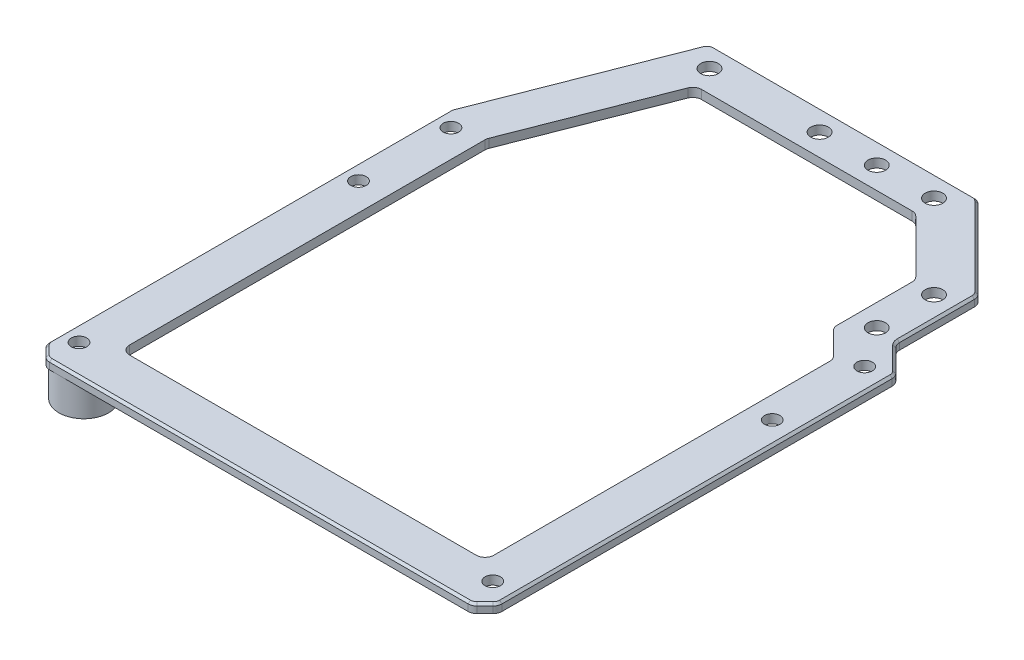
from build123d import *

# Parameters (mm, degrees)
SKETCH_1_W          = 108
SKETCH_1_H          = 92
SKETCH_1_R          = 1.75
EXTRUDE_1_DEPTH     = 2
CUT_EXTRUDE_1_DEPTH = 107.695829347
SKETCH_2_R          = 2
SKETCH_2_R_2        = 1.75
EXTRUDE_2_DEPTH     = 2
FILLET_1_R          = 2
CHAMFER_1_SIZE      = 0.5
SKETCH_5_R          = 5.649372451
EXTRUDE_3_DEPTH     = 7.4


with BuildPart() as part:
    # Sketch 1 → Extrude 1 (new body)
    with BuildSketch(Plane(origin=(0, 0, 0), x_dir=(1, 0, 0), z_dir=(0, 1, 0))):
        with Locations((0, 46)):
            Rectangle(SKETCH_1_W, SKETCH_1_H)
        with Locations(Location((-50.25, 88.25, 0), (0, 0, 270))):
            Circle(SKETCH_1_R, mode=Mode.SUBTRACT)
        with Locations(Location((-50.25, 67.25, 0), (0, 0, 270))):
            Circle(SKETCH_1_R, mode=Mode.SUBTRACT)
        with Locations(Location((-50.25, 3.75, 0), (0, 0, 270))):
            Circle(SKETCH_1_R, mode=Mode.SUBTRACT)
        with Locations(Location((43.75, 3.75, 0), (0, 0, 270))):
            Circle(SKETCH_1_R, mode=Mode.SUBTRACT)
        with Locations(Location((43.75, 67.25, 0), (0, 0, 270))):
            Circle(SKETCH_1_R, mode=Mode.SUBTRACT)
        with Locations(Location((43.75, 88.25, 0), (0, 0, 270))):
            Circle(SKETCH_1_R, mode=Mode.SUBTRACT)
    extrude(amount=EXTRUDE_1_DEPTH)

    # Sketch 3 → Cut-Extrude 1 (cut, through all)
    with BuildSketch(Plane(origin=(0, 2, 0), x_dir=(1, 0, 0), z_dir=(0, 1, 0))):
        Polygon((-43.264471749, 92), (-44, 90.116601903), (-44, 7), (38.75, 7), (38.75, 86.178932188), (32.928932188, 92), align=None)
        Polygon((47.071067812, 92), (48.75, 90.321067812), (48.75, 0), (54, 0), (54, 92), align=None)
    extrude(amount=-CUT_EXTRUDE_1_DEPTH, mode=Mode.SUBTRACT)

    # Sketch 2 → Extrude 2 (add)
    with BuildSketch(Plane(origin=(0, 0, 0), x_dir=(1, 0, 0), z_dir=(0, 1, 0))):
        Polygon((23.5, 134.25), (-37.5, 134.25), (-54, 92), (-54, 0), (-51, -3), (45.75, -3), (48.75, 0), (48.75, 90.321067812), (42.5, 96.571067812), (42.5, 115.25), align=None)
        with Locations(Location((37.5, 97.25, 0), (0, 0, 270))):
            Circle(SKETCH_2_R, mode=Mode.SUBTRACT)
        with Locations(Location((37.5, 110.25, 0), (0, 0, 270))):
            Circle(SKETCH_2_R, mode=Mode.SUBTRACT)
        with Locations(Location((18.5, 129.25, 0), (0, 0, 270))):
            Circle(SKETCH_2_R, mode=Mode.SUBTRACT)
        with Locations(Location((5.5, 129.25, 0), (0, 0, 270))):
            Circle(SKETCH_2_R, mode=Mode.SUBTRACT)
        with Locations(Location((-7.5, 129.25, 0), (0, 0, 270))):
            Circle(SKETCH_2_R, mode=Mode.SUBTRACT)
        with Locations(Location((-32.5, 129.25, 0), (0, 0, 270))):
            Circle(SKETCH_2_R, mode=Mode.SUBTRACT)
        with Locations(Location((43.75, 88.25, 0), (0, 0, 270))):
            Circle(SKETCH_2_R_2, mode=Mode.SUBTRACT)
        with Locations(Location((43.75, 67.25, 0), (0, 0, 270))):
            Circle(SKETCH_2_R_2, mode=Mode.SUBTRACT)
        with Locations(Location((43.75, 3.75, 0), (0, 0, 270))):
            Circle(SKETCH_2_R_2, mode=Mode.SUBTRACT)
        with Locations(Location((-50.25, 3.75, 0), (0, 0, 270))):
            Circle(SKETCH_2_R_2, mode=Mode.SUBTRACT)
        with Locations(Location((-50.25, 67.25, 0), (0, 0, 270))):
            Circle(SKETCH_2_R_2, mode=Mode.SUBTRACT)
        with Locations(Location((-50.25, 88.25, 0), (0, 0, 270))):
            Circle(SKETCH_2_R_2, mode=Mode.SUBTRACT)
        Polygon((32.5, 111.107864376), (19.357864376, 124.25), (-30.669797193, 124.25), (-44, 90.116601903), (-44, 7), (38.75, 7), (38.75, 86.178932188), (32.5, 92.428932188), align=None, mode=Mode.SUBTRACT)
    extrude(amount=EXTRUDE_2_DEPTH)

    # Fillet 1
    fillet_1_edges = [part.edges().sort_by_distance(p)[0] for p in [
        (32.5, 1, -111.107864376),
        (19.357864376, 1, -124.25),
        (-30.669797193, 1, -124.25),
        (38.75, 1, -86.178932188),
        (38.75, 1, -7),
        (-44, 1, -7),
        (-44, 1, -90.116601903),
        (48.75, 1, 0),
        (48.75, 1, -90.321067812),
        (-54, 1, 0),
        (-54, 1, -92),
        (32.5, 1, -92.428932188),
        (-51, 1, 3),
        (45.75, 1, 3),
        (42.5, 1, -96.571067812),
        (42.5, 1, -115.25),
        (23.5, 1, -134.25),
        (-37.5, 1, -134.25),
    ]]
    fillet(fillet_1_edges, radius=FILLET_1_R)

    # Chamfer 1
    chamfer_1_edges = [part.edges().sort_by_distance(p)[0] for p in [
        (-6.731193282, 2, -134.25),
        (33, 2, -124.75),
        (45.625, 2, -93.446067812),
        (42.5, 2, -105.910533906),
        (-45.929952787, 2, -112.664211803),
        (-54, 2, -46.225873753),
        (-52.5, 2, 1.5),
        (-2.625, 2, 3),
        (47.25, 2, 1.5),
        (48.75, 2, -45.160533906),
        (48.597759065, 2, -0.06306026),
        (45.68693974, 2, 2.847759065),
        (-50.93693974, 2, 2.847759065),
        (-53.847759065, 2, -0.06306026),
        (-53.965444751, 2, -91.993491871),
        (-37.261987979, 2, -133.901530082),
        (48.597759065, 2, -90.258007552),
        (42.347759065, 2, -115.18693974),
        (23.43693974, 2, -134.097759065),
        (42.652240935, 2, -96.634128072),
    ]]
    chamfer(chamfer_1_edges, length=CHAMFER_1_SIZE)

    # Sketch 5 → Extrude 3 (add)
    with BuildSketch(Plane.XZ):
        with Locations(Location((-48.061348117, -2.649372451, 0), (0, 0, 90))):
            Circle(SKETCH_5_R)
    extrude(amount=EXTRUDE_3_DEPTH)


solid = part.part
